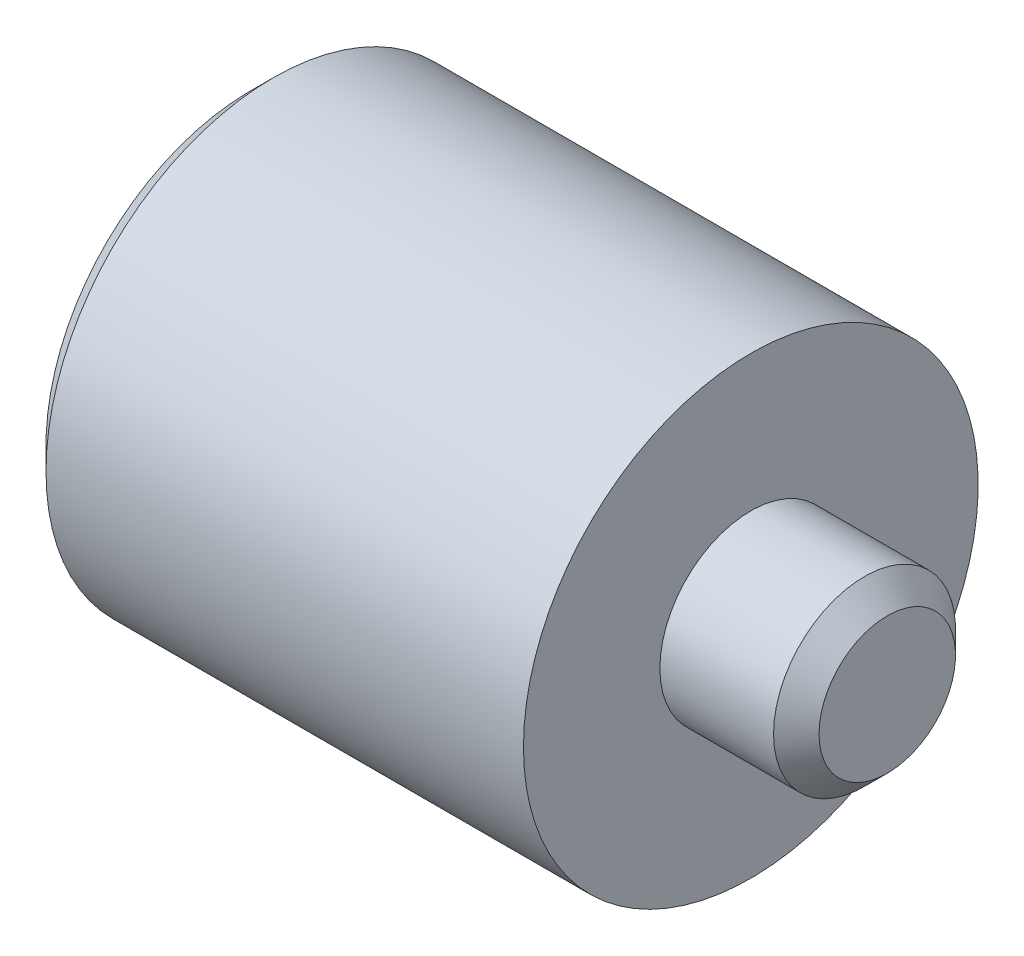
ISO-10303-21;
HEADER;
FILE_DESCRIPTION(('STEP AP214'),'2;1');
FILE_NAME('part.step','',(''),(''),'','','');
FILE_SCHEMA(('AUTOMOTIVE_DESIGN { 1 0 10303 214 1 1 1 1 }'));
ENDSEC;
DATA;
#1=APPLICATION_CONTEXT('core data for automotive mechanical design processes');
#2=APPLICATION_PROTOCOL_DEFINITION('international standard','automotive_design',2000,#1);
#3=PRODUCT_CONTEXT('',#1,'mechanical');
#4=PRODUCT('Part','Part','',(#3));
#5=PRODUCT_RELATED_PRODUCT_CATEGORY('part','',(#4));
#6=PRODUCT_DEFINITION_FORMATION('','',#4);
#7=PRODUCT_DEFINITION_CONTEXT('part definition',#1,'design');
#8=PRODUCT_DEFINITION('design','',#6,#7);
#9=PRODUCT_DEFINITION_SHAPE('','',#8);
#10=(LENGTH_UNIT() NAMED_UNIT(*) SI_UNIT(.MILLI.,.METRE.));
#11=(NAMED_UNIT(*) PLANE_ANGLE_UNIT() SI_UNIT($,.RADIAN.));
#12=(NAMED_UNIT(*) SI_UNIT($,.STERADIAN.) SOLID_ANGLE_UNIT());
#13=UNCERTAINTY_MEASURE_WITH_UNIT(LENGTH_MEASURE(1.E-05),#10,'distance_accuracy_value','');
#14=(GEOMETRIC_REPRESENTATION_CONTEXT(3) GLOBAL_UNCERTAINTY_ASSIGNED_CONTEXT((#13)) GLOBAL_UNIT_ASSIGNED_CONTEXT((#10,
#11,#12)) REPRESENTATION_CONTEXT('',''));
#15=CARTESIAN_POINT('',(0.,0.,0.));
#16=DIRECTION('',(0.,0.,1.));
#17=DIRECTION('',(1.,0.,0.));
#18=AXIS2_PLACEMENT_3D('',#15,#16,#17);
#19=CARTESIAN_POINT('',(0.,0.,0.));
#20=DIRECTION('',(1.,0.,0.));
#21=DIRECTION('',(0.,0.,-1.));
#22=AXIS2_PLACEMENT_3D('',#19,#20,#21);
#23=PLANE('',#22);
#24=CARTESIAN_POINT('',(0.,0.,0.));
#25=DIRECTION('',(1.,0.,0.));
#26=DIRECTION('',(0.,0.,-1.));
#27=AXIS2_PLACEMENT_3D('',#24,#25,#26);
#28=CIRCLE('',#27,4.5);
#29=CARTESIAN_POINT('',(0.,0.,-4.5));
#30=VERTEX_POINT('',#29);
#31=EDGE_CURVE('E45',#30,#30,#28,.F.);
#32=ORIENTED_EDGE('',*,*,#31,.T.);
#33=EDGE_LOOP('',(#32));
#34=FACE_BOUND('',#33,.T.);
#35=ADVANCED_FACE('F31',(#34),#23,.F.);
#36=CARTESIAN_POINT('',(-13.0085020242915,0.,0.));
#37=DIRECTION('',(-1.,0.,0.));
#38=DIRECTION('',(0.,0.,1.));
#39=AXIS2_PLACEMENT_3D('',#36,#37,#38);
#40=CYLINDRICAL_SURFACE('',#39,5.);
#41=CARTESIAN_POINT('',(0.5,0.,0.));
#42=DIRECTION('',(1.,0.,0.));
#43=DIRECTION('',(0.,0.,-1.));
#44=AXIS2_PLACEMENT_3D('',#41,#42,#43);
#45=CIRCLE('',#44,5.);
#46=CARTESIAN_POINT('',(0.5,0.,-5.));
#47=VERTEX_POINT('',#46);
#48=EDGE_CURVE('E41',#47,#47,#45,.T.);
#49=ORIENTED_EDGE('',*,*,#48,.T.);
#50=EDGE_LOOP('',(#49));
#51=FACE_BOUND('',#50,.T.);
#52=CARTESIAN_POINT('',(11.,0.,0.));
#53=DIRECTION('',(-1.,0.,0.));
#54=DIRECTION('',(0.,0.,1.));
#55=AXIS2_PLACEMENT_3D('',#52,#53,#54);
#56=CIRCLE('',#55,5.);
#57=CARTESIAN_POINT('',(11.,0.,5.));
#58=VERTEX_POINT('',#57);
#59=EDGE_CURVE('E50',#58,#58,#56,.T.);
#60=ORIENTED_EDGE('',*,*,#59,.T.);
#61=EDGE_LOOP('',(#60));
#62=FACE_BOUND('',#61,.T.);
#63=ADVANCED_FACE('F69',(#51,#62),#40,.T.);
#64=CARTESIAN_POINT('',(11.,5.,0.));
#65=DIRECTION('',(-1.,0.,0.));
#66=DIRECTION('',(0.,0.,1.));
#67=AXIS2_PLACEMENT_3D('',#64,#65,#66);
#68=PLANE('',#67);
#69=ORIENTED_EDGE('',*,*,#59,.F.);
#70=EDGE_LOOP('',(#69));
#71=FACE_BOUND('',#70,.T.);
#72=CARTESIAN_POINT('',(11.,0.,0.));
#73=DIRECTION('',(-1.,0.,0.));
#74=DIRECTION('',(0.,0.,1.));
#75=AXIS2_PLACEMENT_3D('',#72,#73,#74);
#76=CIRCLE('',#75,2.);
#77=CARTESIAN_POINT('',(11.,0.,2.));
#78=VERTEX_POINT('',#77);
#79=EDGE_CURVE('E53',#78,#78,#76,.T.);
#80=ORIENTED_EDGE('',*,*,#79,.T.);
#81=EDGE_LOOP('',(#80));
#82=FACE_BOUND('',#81,.T.);
#83=ADVANCED_FACE('F57',(#71,#82),#68,.F.);
#84=CARTESIAN_POINT('',(-13.0085020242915,0.,0.));
#85=DIRECTION('',(-1.,0.,0.));
#86=DIRECTION('',(0.,0.,1.));
#87=AXIS2_PLACEMENT_3D('',#84,#85,#86);
#88=CYLINDRICAL_SURFACE('',#87,2.);
#89=CARTESIAN_POINT('',(13.5,0.,0.));
#90=DIRECTION('',(-1.,0.,0.));
#91=DIRECTION('',(0.,0.,1.));
#92=AXIS2_PLACEMENT_3D('',#89,#90,#91);
#93=CIRCLE('',#92,2.);
#94=CARTESIAN_POINT('',(13.5,0.,2.));
#95=VERTEX_POINT('',#94);
#96=EDGE_CURVE('E37',#95,#95,#93,.T.);
#97=ORIENTED_EDGE('',*,*,#96,.T.);
#98=EDGE_LOOP('',(#97));
#99=FACE_BOUND('',#98,.T.);
#100=ORIENTED_EDGE('',*,*,#79,.F.);
#101=EDGE_LOOP('',(#100));
#102=FACE_BOUND('',#101,.T.);
#103=ADVANCED_FACE('F59',(#99,#102),#88,.T.);
#104=CARTESIAN_POINT('',(14.,2.,0.));
#105=DIRECTION('',(-1.,0.,0.));
#106=DIRECTION('',(0.,0.,1.));
#107=AXIS2_PLACEMENT_3D('',#104,#105,#106);
#108=PLANE('',#107);
#109=CARTESIAN_POINT('',(14.,0.,0.));
#110=DIRECTION('',(-1.,0.,0.));
#111=DIRECTION('',(0.,0.,1.));
#112=AXIS2_PLACEMENT_3D('',#109,#110,#111);
#113=CIRCLE('',#112,1.5);
#114=CARTESIAN_POINT('',(14.,0.,1.5));
#115=VERTEX_POINT('',#114);
#116=EDGE_CURVE('E10',#115,#115,#113,.F.);
#117=ORIENTED_EDGE('',*,*,#116,.T.);
#118=EDGE_LOOP('',(#117));
#119=FACE_BOUND('',#118,.T.);
#120=ADVANCED_FACE('F61',(#119),#108,.F.);
#121=CARTESIAN_POINT('',(0.,0.,0.));
#122=DIRECTION('',(1.,0.,0.));
#123=DIRECTION('',(0.,0.,-1.));
#124=AXIS2_PLACEMENT_3D('',#121,#122,#123);
#125=CONICAL_SURFACE('',#124,4.5,0.785398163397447);
#126=ORIENTED_EDGE('',*,*,#48,.F.);
#127=EDGE_LOOP('',(#126));
#128=FACE_BOUND('',#127,.T.);
#129=ORIENTED_EDGE('',*,*,#31,.F.);
#130=EDGE_LOOP('',(#129));
#131=FACE_BOUND('',#130,.T.);
#132=ADVANCED_FACE('F67',(#128,#131),#125,.T.);
#133=CARTESIAN_POINT('',(13.5,0.,0.));
#134=DIRECTION('',(-1.,0.,0.));
#135=DIRECTION('',(0.,0.,1.));
#136=AXIS2_PLACEMENT_3D('',#133,#134,#135);
#137=CONICAL_SURFACE('',#136,2.,0.785398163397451);
#138=ORIENTED_EDGE('',*,*,#116,.F.);
#139=EDGE_LOOP('',(#138));
#140=FACE_BOUND('',#139,.T.);
#141=ORIENTED_EDGE('',*,*,#96,.F.);
#142=EDGE_LOOP('',(#141));
#143=FACE_BOUND('',#142,.T.);
#144=ADVANCED_FACE('F81',(#140,#143),#137,.T.);
#145=CLOSED_SHELL('',(#35,#63,#83,#103,#120,#132,#144));
#146=MANIFOLD_SOLID_BREP('B2',#145);
#147=ADVANCED_BREP_SHAPE_REPRESENTATION('',(#18,#146),#14);
#148=SHAPE_DEFINITION_REPRESENTATION(#9,#147);
ENDSEC;
END-ISO-10303-21;
